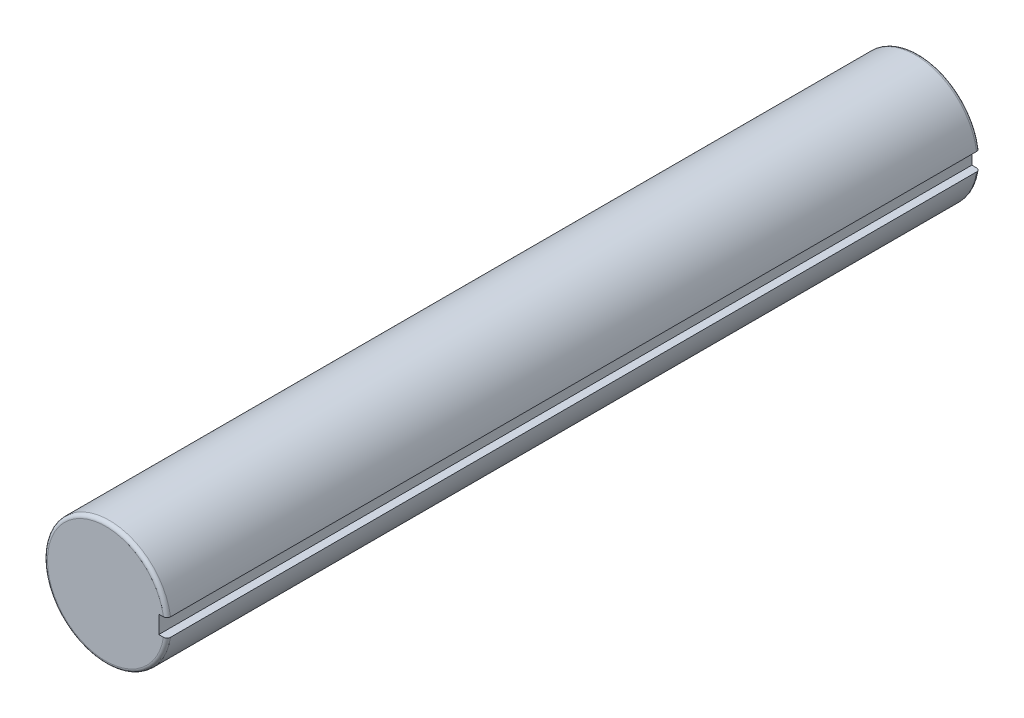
ISO-10303-21;
HEADER;
FILE_DESCRIPTION(('STEP AP214'),'2;1');
FILE_NAME('part.step','',(''),(''),'','','');
FILE_SCHEMA(('AUTOMOTIVE_DESIGN { 1 0 10303 214 1 1 1 1 }'));
ENDSEC;
DATA;
#1=APPLICATION_CONTEXT('core data for automotive mechanical design processes');
#2=APPLICATION_PROTOCOL_DEFINITION('international standard','automotive_design',2000,#1);
#3=PRODUCT_CONTEXT('',#1,'mechanical');
#4=PRODUCT('Part','Part','',(#3));
#5=PRODUCT_RELATED_PRODUCT_CATEGORY('part','',(#4));
#6=PRODUCT_DEFINITION_FORMATION('','',#4);
#7=PRODUCT_DEFINITION_CONTEXT('part definition',#1,'design');
#8=PRODUCT_DEFINITION('design','',#6,#7);
#9=PRODUCT_DEFINITION_SHAPE('','',#8);
#10=(LENGTH_UNIT() NAMED_UNIT(*) SI_UNIT(.MILLI.,.METRE.));
#11=(NAMED_UNIT(*) PLANE_ANGLE_UNIT() SI_UNIT($,.RADIAN.));
#12=(NAMED_UNIT(*) SI_UNIT($,.STERADIAN.) SOLID_ANGLE_UNIT());
#13=UNCERTAINTY_MEASURE_WITH_UNIT(LENGTH_MEASURE(1.E-05),#10,'distance_accuracy_value','');
#14=(GEOMETRIC_REPRESENTATION_CONTEXT(3) GLOBAL_UNCERTAINTY_ASSIGNED_CONTEXT((#13)) GLOBAL_UNIT_ASSIGNED_CONTEXT((#10,
#11,#12)) REPRESENTATION_CONTEXT('',''));
#15=CARTESIAN_POINT('',(0.,0.,0.));
#16=DIRECTION('',(0.,0.,1.));
#17=DIRECTION('',(1.,0.,0.));
#18=AXIS2_PLACEMENT_3D('',#15,#16,#17);
#19=CARTESIAN_POINT('',(0.,0.635,58.42));
#20=DIRECTION('',(0.,1.,0.));
#21=DIRECTION('',(0.,0.,1.));
#22=AXIS2_PLACEMENT_3D('',#19,#20,#21);
#23=PLANE('',#22);
#24=DIRECTION('',(0.,0.,-1.));
#25=VECTOR('',#24,1.);
#26=CARTESIAN_POINT('',(4.39940905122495,0.635,58.42));
#27=LINE('',#26,#25);
#28=CARTESIAN_POINT('',(4.39940905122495,0.635,58.166));
#29=VERTEX_POINT('',#28);
#30=CARTESIAN_POINT('',(4.39940905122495,0.635,0.254000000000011));
#31=VERTEX_POINT('',#30);
#32=EDGE_CURVE('E125',#29,#31,#27,.T.);
#33=ORIENTED_EDGE('',*,*,#32,.F.);
#34=CARTESIAN_POINT('',(4.39940905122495,0.635,58.166));
#35=CARTESIAN_POINT('',(4.39942176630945,0.635,58.1801816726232));
#36=CARTESIAN_POINT('',(4.39820981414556,0.635,58.1943588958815));
#37=CARTESIAN_POINT('',(4.39343137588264,0.635,58.2222959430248));
#38=CARTESIAN_POINT('',(4.38986740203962,0.635,58.2360561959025));
#39=CARTESIAN_POINT('',(4.38047754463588,0.635,58.2627878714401));
#40=CARTESIAN_POINT('',(4.37465079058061,0.635,58.2757589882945));
#41=CARTESIAN_POINT('',(4.36091302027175,0.635,58.3005433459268));
#42=CARTESIAN_POINT('',(4.35300220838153,0.635,58.3123567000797));
#43=CARTESIAN_POINT('',(4.3352874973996,0.635,58.3345504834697));
#44=CARTESIAN_POINT('',(4.32547554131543,0.635,58.3449244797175));
#45=CARTESIAN_POINT('',(4.30426237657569,0.635,58.3638991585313));
#46=CARTESIAN_POINT('',(4.29286083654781,0.635,58.3724994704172));
#47=CARTESIAN_POINT('',(4.26867421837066,0.635,58.387772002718));
#48=CARTESIAN_POINT('',(4.25587650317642,0.635,58.3944241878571));
#49=CARTESIAN_POINT('',(4.22935551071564,0.635,58.4055074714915));
#50=CARTESIAN_POINT('',(4.21563262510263,0.635,58.4099395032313));
#51=CARTESIAN_POINT('',(4.19197121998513,0.635,58.4154634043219));
#52=CARTESIAN_POINT('',(4.18217018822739,0.635,58.4171637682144));
#53=CARTESIAN_POINT('',(4.16245219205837,0.635,58.4194319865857));
#54=CARTESIAN_POINT('',(4.15253541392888,0.635,58.4200014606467));
#55=CARTESIAN_POINT('',(4.14261463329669,0.635,58.420000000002));
#56=B_SPLINE_CURVE_WITH_KNOTS('',3,(#34,#35,#36,#37,#38,#39,#40,#41,#42,#43,#44,#45,#46,#47,#48,
#49,#50,#51,#52,#53,#54,#55),.UNSPECIFIED.,.F.,.F.,(4,2,2,2,2,2,2,2,2,2,4),(0.,
0.0424867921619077,0.0849282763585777,0.127386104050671,0.169839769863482,0.212477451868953,
0.255124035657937,0.298194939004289,0.341247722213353,0.371028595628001,0.400766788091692),.UNSPECIFIED.);
#57=CARTESIAN_POINT('',(4.14261463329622,0.635,58.42));
#58=VERTEX_POINT('',#57);
#59=EDGE_CURVE('E44',#29,#58,#56,.T.);
#60=ORIENTED_EDGE('',*,*,#59,.T.);
#61=DIRECTION('',(1.,0.,0.));
#62=VECTOR('',#61,1.);
#63=CARTESIAN_POINT('',(0.,0.635,58.42));
#64=LINE('',#63,#62);
#65=CARTESIAN_POINT('',(3.81,0.635,58.42));
#66=VERTEX_POINT('',#65);
#67=EDGE_CURVE('E110',#66,#58,#64,.T.);
#68=ORIENTED_EDGE('',*,*,#67,.F.);
#69=DIRECTION('',(0.,0.,-1.));
#70=VECTOR('',#69,1.);
#71=CARTESIAN_POINT('',(3.81,0.635,58.42));
#72=LINE('',#71,#70);
#73=CARTESIAN_POINT('',(3.81,0.635,0.));
#74=VERTEX_POINT('',#73);
#75=EDGE_CURVE('E100',#66,#74,#72,.T.);
#76=ORIENTED_EDGE('',*,*,#75,.T.);
#77=DIRECTION('',(1.,0.,0.));
#78=VECTOR('',#77,1.);
#79=CARTESIAN_POINT('',(0.,0.635,0.));
#80=LINE('',#79,#78);
#81=CARTESIAN_POINT('',(4.14261463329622,0.635,0.));
#82=VERTEX_POINT('',#81);
#83=EDGE_CURVE('E118',#74,#82,#80,.T.);
#84=ORIENTED_EDGE('',*,*,#83,.T.);
#85=CARTESIAN_POINT('',(4.14261463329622,0.635,0.));
#86=CARTESIAN_POINT('',(4.15718170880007,0.635,-1.16527317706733E-05));
#87=CARTESIAN_POINT('',(4.171746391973,0.635,0.00122371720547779));
#88=CARTESIAN_POINT('',(4.20045979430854,0.635,0.00610581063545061));
#89=CARTESIAN_POINT('',(4.21460868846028,0.635,0.00975150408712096));
#90=CARTESIAN_POINT('',(4.24210101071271,0.635,0.0193746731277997));
#91=CARTESIAN_POINT('',(4.25544393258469,0.635,0.0253535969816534));
#92=CARTESIAN_POINT('',(4.28092530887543,0.635,0.039477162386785));
#93=CARTESIAN_POINT('',(4.2930641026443,0.635,0.047621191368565));
#94=CARTESIAN_POINT('',(4.31571759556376,0.635,0.0657996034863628));
#95=CARTESIAN_POINT('',(4.32624125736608,0.635,0.0758228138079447));
#96=CARTESIAN_POINT('',(4.34543706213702,0.635,0.0975130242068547));
#97=CARTESIAN_POINT('',(4.35410887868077,0.635,0.109180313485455));
#98=CARTESIAN_POINT('',(4.36925666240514,0.635,0.13369531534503));
#99=CARTESIAN_POINT('',(4.37575425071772,0.635,0.146529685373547));
#100=CARTESIAN_POINT('',(4.38647586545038,0.635,0.173110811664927));
#101=CARTESIAN_POINT('',(4.39070156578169,0.635,0.186856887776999));
#102=CARTESIAN_POINT('',(4.39561635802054,0.635,0.209584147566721));
#103=CARTESIAN_POINT('',(4.39703779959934,0.635,0.218413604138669));
#104=CARTESIAN_POINT('',(4.39893393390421,0.635,0.236160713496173));
#105=CARTESIAN_POINT('',(4.39940998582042,0.635,0.245078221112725));
#106=CARTESIAN_POINT('',(4.3994090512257,0.635,0.253999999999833));
#107=B_SPLINE_CURVE_WITH_KNOTS('',3,(#85,#86,#87,#88,#89,#90,#91,#92,#93,#94,#95,#96,#97,#98,
#99,#100,#101,#102,#103,#104,#105,#106),.UNSPECIFIED.,.F.,.F.,(4,2,2,2,2,2,2,2,2,2,4),(0.,
0.0436457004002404,0.0872727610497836,0.130926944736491,0.174568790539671,0.217958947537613,
0.261356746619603,0.30430918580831,0.347229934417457,0.374012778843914,0.400757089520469),.UNSPECIFIED.);
#108=EDGE_CURVE('E56',#82,#31,#107,.T.);
#109=ORIENTED_EDGE('',*,*,#108,.T.);
#110=EDGE_LOOP('',(#33,#60,#68,#76,#84,#109));
#111=FACE_BOUND('',#110,.T.);
#112=ADVANCED_FACE('F35',(#111),#23,.F.);
#113=CARTESIAN_POINT('',(0.,0.,58.42));
#114=DIRECTION('',(0.,0.,-1.));
#115=DIRECTION('',(-1.,0.,0.));
#116=AXIS2_PLACEMENT_3D('',#113,#114,#115);
#117=CYLINDRICAL_SURFACE('',#116,4.445);
#118=DIRECTION('',(0.,0.,-1.));
#119=VECTOR('',#118,1.);
#120=CARTESIAN_POINT('',(4.39940905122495,-0.635,58.42));
#121=LINE('',#120,#119);
#122=CARTESIAN_POINT('',(4.39940905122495,-0.635,58.166));
#123=VERTEX_POINT('',#122);
#124=CARTESIAN_POINT('',(4.39940905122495,-0.635,0.254000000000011));
#125=VERTEX_POINT('',#124);
#126=EDGE_CURVE('E99',#123,#125,#121,.T.);
#127=ORIENTED_EDGE('',*,*,#126,.F.);
#128=CARTESIAN_POINT('',(0.,0.,58.166));
#129=DIRECTION('',(0.,0.,1.));
#130=DIRECTION('',(1.,0.,0.));
#131=AXIS2_PLACEMENT_3D('',#128,#129,#130);
#132=CIRCLE('',#131,4.445);
#133=EDGE_CURVE('E163',#123,#29,#132,.F.);
#134=ORIENTED_EDGE('',*,*,#133,.T.);
#135=ORIENTED_EDGE('',*,*,#32,.T.);
#136=CARTESIAN_POINT('',(0.,0.,0.253999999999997));
#137=DIRECTION('',(0.,0.,1.));
#138=DIRECTION('',(1.,0.,0.));
#139=AXIS2_PLACEMENT_3D('',#136,#137,#138);
#140=CIRCLE('',#139,4.445);
#141=EDGE_CURVE('E164',#31,#125,#140,.T.);
#142=ORIENTED_EDGE('',*,*,#141,.T.);
#143=EDGE_LOOP('',(#127,#134,#135,#142));
#144=FACE_BOUND('',#143,.T.);
#145=ADVANCED_FACE('F143',(#144),#117,.T.);
#146=CARTESIAN_POINT('',(0.,-0.635,58.42));
#147=DIRECTION('',(0.,1.,0.));
#148=DIRECTION('',(0.,0.,1.));
#149=AXIS2_PLACEMENT_3D('',#146,#147,#148);
#150=PLANE('',#149);
#151=DIRECTION('',(1.,0.,0.));
#152=VECTOR('',#151,1.);
#153=CARTESIAN_POINT('',(0.,-0.635,58.42));
#154=LINE('',#153,#152);
#155=CARTESIAN_POINT('',(3.81,-0.635,58.42));
#156=VERTEX_POINT('',#155);
#157=CARTESIAN_POINT('',(4.14261463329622,-0.635,58.42));
#158=VERTEX_POINT('',#157);
#159=EDGE_CURVE('E93',#156,#158,#154,.T.);
#160=ORIENTED_EDGE('',*,*,#159,.T.);
#161=CARTESIAN_POINT('',(4.14261463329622,-0.635,58.42));
#162=CARTESIAN_POINT('',(4.15718170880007,-0.635,58.4200116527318));
#163=CARTESIAN_POINT('',(4.171746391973,-0.635,58.4187762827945));
#164=CARTESIAN_POINT('',(4.20045979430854,-0.635,58.4138941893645));
#165=CARTESIAN_POINT('',(4.21460868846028,-0.635,58.4102484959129));
#166=CARTESIAN_POINT('',(4.24210101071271,-0.635,58.4006253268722));
#167=CARTESIAN_POINT('',(4.25544393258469,-0.635,58.3946464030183));
#168=CARTESIAN_POINT('',(4.28092530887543,-0.635,58.3805228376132));
#169=CARTESIAN_POINT('',(4.2930641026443,-0.635,58.3723788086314));
#170=CARTESIAN_POINT('',(4.31571759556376,-0.635,58.3542003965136));
#171=CARTESIAN_POINT('',(4.32624125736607,-0.635,58.344177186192));
#172=CARTESIAN_POINT('',(4.34543706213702,-0.635,58.3224869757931));
#173=CARTESIAN_POINT('',(4.35410887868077,-0.635,58.3108196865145));
#174=CARTESIAN_POINT('',(4.36925666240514,-0.635,58.286304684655));
#175=CARTESIAN_POINT('',(4.37575425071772,-0.635,58.2734703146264));
#176=CARTESIAN_POINT('',(4.38647586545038,-0.635,58.2468891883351));
#177=CARTESIAN_POINT('',(4.39070156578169,-0.635,58.233143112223));
#178=CARTESIAN_POINT('',(4.39561635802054,-0.635,58.2104158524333));
#179=CARTESIAN_POINT('',(4.39703779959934,-0.635,58.2015863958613));
#180=CARTESIAN_POINT('',(4.39893393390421,-0.635,58.1838392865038));
#181=CARTESIAN_POINT('',(4.39940998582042,-0.635,58.1749217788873));
#182=CARTESIAN_POINT('',(4.3994090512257,-0.635,58.1660000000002));
#183=B_SPLINE_CURVE_WITH_KNOTS('',3,(#161,#162,#163,#164,#165,#166,#167,#168,#169,#170,#171,
#172,#173,#174,#175,#176,#177,#178,#179,#180,#181,#182),.UNSPECIFIED.,.F.,.F.,(4,2,2,2,2,2,2,2,
2,2,4),(0.,0.0436457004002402,0.087272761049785,0.130926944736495,0.174568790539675,
0.217958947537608,0.261356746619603,0.304309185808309,0.347229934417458,0.374012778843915,
0.400757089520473),.UNSPECIFIED.);
#184=EDGE_CURVE('E134',#158,#123,#183,.T.);
#185=ORIENTED_EDGE('',*,*,#184,.T.);
#186=ORIENTED_EDGE('',*,*,#126,.T.);
#187=CARTESIAN_POINT('',(4.39940905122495,-0.635,0.253999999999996));
#188=CARTESIAN_POINT('',(4.39942176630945,-0.635,0.239818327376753));
#189=CARTESIAN_POINT('',(4.39820981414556,-0.635,0.225641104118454));
#190=CARTESIAN_POINT('',(4.39343137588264,-0.635,0.197704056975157));
#191=CARTESIAN_POINT('',(4.38986740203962,-0.635,0.183943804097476));
#192=CARTESIAN_POINT('',(4.38047754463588,-0.635,0.157212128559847));
#193=CARTESIAN_POINT('',(4.3746507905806,-0.635,0.144241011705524));
#194=CARTESIAN_POINT('',(4.36091302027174,-0.635,0.119456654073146));
#195=CARTESIAN_POINT('',(4.35300220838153,-0.635,0.107643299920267));
#196=CARTESIAN_POINT('',(4.3352874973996,-0.635,0.0854495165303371));
#197=CARTESIAN_POINT('',(4.32547554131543,-0.635,0.0750755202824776));
#198=CARTESIAN_POINT('',(4.30426237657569,-0.635,0.0561008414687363));
#199=CARTESIAN_POINT('',(4.29286083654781,-0.635,0.0475005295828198));
#200=CARTESIAN_POINT('',(4.26867421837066,-0.635,0.0322279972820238));
#201=CARTESIAN_POINT('',(4.25587650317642,-0.635,0.0255758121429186));
#202=CARTESIAN_POINT('',(4.22935551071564,-0.635,0.0144925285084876));
#203=CARTESIAN_POINT('',(4.21563262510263,-0.635,0.010060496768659));
#204=CARTESIAN_POINT('',(4.19197121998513,-0.635,0.00453659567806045));
#205=CARTESIAN_POINT('',(4.18217018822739,-0.635,0.002836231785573));
#206=CARTESIAN_POINT('',(4.16245219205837,-0.635,0.000568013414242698));
#207=CARTESIAN_POINT('',(4.15253541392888,-0.635,-1.46064669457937E-06));
#208=CARTESIAN_POINT('',(4.14261463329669,-0.635,-1.99548456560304E-12));
#209=B_SPLINE_CURVE_WITH_KNOTS('',3,(#187,#188,#189,#190,#191,#192,#193,#194,#195,#196,#197,
#198,#199,#200,#201,#202,#203,#204,#205,#206,#207,#208),.UNSPECIFIED.,.F.,.F.,(4,2,2,2,2,2,2,2,
2,2,4),(0.,0.042486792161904,0.0849282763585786,0.127386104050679,0.169839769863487,
0.212477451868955,0.255124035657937,0.29819493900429,0.341247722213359,0.371028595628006,
0.400766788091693),.UNSPECIFIED.);
#210=CARTESIAN_POINT('',(4.14261463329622,-0.635,0.));
#211=VERTEX_POINT('',#210);
#212=EDGE_CURVE('E128',#125,#211,#209,.T.);
#213=ORIENTED_EDGE('',*,*,#212,.T.);
#214=DIRECTION('',(1.,0.,0.));
#215=VECTOR('',#214,1.);
#216=CARTESIAN_POINT('',(0.,-0.635,0.));
#217=LINE('',#216,#215);
#218=CARTESIAN_POINT('',(3.81,-0.635,0.));
#219=VERTEX_POINT('',#218);
#220=EDGE_CURVE('E94',#219,#211,#217,.T.);
#221=ORIENTED_EDGE('',*,*,#220,.F.);
#222=DIRECTION('',(0.,0.,-1.));
#223=VECTOR('',#222,1.);
#224=CARTESIAN_POINT('',(3.81,-0.635,58.42));
#225=LINE('',#224,#223);
#226=EDGE_CURVE('E90',#156,#219,#225,.T.);
#227=ORIENTED_EDGE('',*,*,#226,.F.);
#228=EDGE_LOOP('',(#160,#185,#186,#213,#221,#227));
#229=FACE_BOUND('',#228,.T.);
#230=ADVANCED_FACE('F92',(#229),#150,.T.);
#231=CARTESIAN_POINT('',(3.81,0.,58.42));
#232=DIRECTION('',(1.,0.,0.));
#233=DIRECTION('',(0.,0.,-1.));
#234=AXIS2_PLACEMENT_3D('',#231,#232,#233);
#235=PLANE('',#234);
#236=DIRECTION('',(0.,-1.,0.));
#237=VECTOR('',#236,1.);
#238=CARTESIAN_POINT('',(3.81,0.,0.));
#239=LINE('',#238,#237);
#240=EDGE_CURVE('E121',#74,#219,#239,.T.);
#241=ORIENTED_EDGE('',*,*,#240,.F.);
#242=ORIENTED_EDGE('',*,*,#75,.F.);
#243=DIRECTION('',(0.,-1.,0.));
#244=VECTOR('',#243,1.);
#245=CARTESIAN_POINT('',(3.81,0.,58.42));
#246=LINE('',#245,#244);
#247=EDGE_CURVE('E107',#66,#156,#246,.T.);
#248=ORIENTED_EDGE('',*,*,#247,.T.);
#249=ORIENTED_EDGE('',*,*,#226,.T.);
#250=EDGE_LOOP('',(#241,#242,#248,#249));
#251=FACE_BOUND('',#250,.T.);
#252=ADVANCED_FACE('F112',(#251),#235,.T.);
#253=CARTESIAN_POINT('',(0.,0.,58.42));
#254=DIRECTION('',(0.,0.,1.));
#255=DIRECTION('',(1.,0.,0.));
#256=AXIS2_PLACEMENT_3D('',#253,#254,#255);
#257=PLANE('',#256);
#258=ORIENTED_EDGE('',*,*,#67,.T.);
#259=CARTESIAN_POINT('',(0.,0.,58.42));
#260=DIRECTION('',(0.,0.,1.));
#261=DIRECTION('',(1.,0.,0.));
#262=AXIS2_PLACEMENT_3D('',#259,#260,#261);
#263=CIRCLE('',#262,4.191);
#264=EDGE_CURVE('E109',#58,#158,#263,.T.);
#265=ORIENTED_EDGE('',*,*,#264,.T.);
#266=ORIENTED_EDGE('',*,*,#159,.F.);
#267=ORIENTED_EDGE('',*,*,#247,.F.);
#268=EDGE_LOOP('',(#258,#265,#266,#267));
#269=FACE_BOUND('',#268,.T.);
#270=ADVANCED_FACE('F106',(#269),#257,.T.);
#271=CARTESIAN_POINT('',(0.,0.,0.));
#272=DIRECTION('',(0.,0.,1.));
#273=DIRECTION('',(1.,0.,0.));
#274=AXIS2_PLACEMENT_3D('',#271,#272,#273);
#275=PLANE('',#274);
#276=ORIENTED_EDGE('',*,*,#220,.T.);
#277=CARTESIAN_POINT('',(0.,0.,0.));
#278=DIRECTION('',(0.,0.,1.));
#279=DIRECTION('',(1.,0.,0.));
#280=AXIS2_PLACEMENT_3D('',#277,#278,#279);
#281=CIRCLE('',#280,4.191);
#282=EDGE_CURVE('E11',#211,#82,#281,.F.);
#283=ORIENTED_EDGE('',*,*,#282,.T.);
#284=ORIENTED_EDGE('',*,*,#83,.F.);
#285=ORIENTED_EDGE('',*,*,#240,.T.);
#286=EDGE_LOOP('',(#276,#283,#284,#285));
#287=FACE_BOUND('',#286,.T.);
#288=ADVANCED_FACE('F171',(#287),#275,.F.);
#289=CARTESIAN_POINT('',(0.,0.,58.166));
#290=DIRECTION('',(0.,0.,1.));
#291=DIRECTION('',(1.,0.,0.));
#292=AXIS2_PLACEMENT_3D('',#289,#290,#291);
#293=TOROIDAL_SURFACE('',#292,4.191,0.254);
#294=ORIENTED_EDGE('',*,*,#59,.F.);
#295=ORIENTED_EDGE('',*,*,#133,.F.);
#296=ORIENTED_EDGE('',*,*,#184,.F.);
#297=ORIENTED_EDGE('',*,*,#264,.F.);
#298=EDGE_LOOP('',(#294,#295,#296,#297));
#299=FACE_BOUND('',#298,.T.);
#300=ADVANCED_FACE('F151',(#299),#293,.T.);
#301=CARTESIAN_POINT('',(0.,0.,0.253999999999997));
#302=DIRECTION('',(0.,0.,1.));
#303=DIRECTION('',(1.,0.,0.));
#304=AXIS2_PLACEMENT_3D('',#301,#302,#303);
#305=TOROIDAL_SURFACE('',#304,4.191,0.254);
#306=ORIENTED_EDGE('',*,*,#108,.F.);
#307=ORIENTED_EDGE('',*,*,#282,.F.);
#308=ORIENTED_EDGE('',*,*,#212,.F.);
#309=ORIENTED_EDGE('',*,*,#141,.F.);
#310=EDGE_LOOP('',(#306,#307,#308,#309));
#311=FACE_BOUND('',#310,.T.);
#312=ADVANCED_FACE('F37',(#311),#305,.T.);
#313=CLOSED_SHELL('',(#112,#145,#230,#252,#270,#288,#300,#312));
#314=MANIFOLD_SOLID_BREP('B2',#313);
#315=ADVANCED_BREP_SHAPE_REPRESENTATION('',(#18,#314),#14);
#316=SHAPE_DEFINITION_REPRESENTATION(#9,#315);
ENDSEC;
END-ISO-10303-21;
